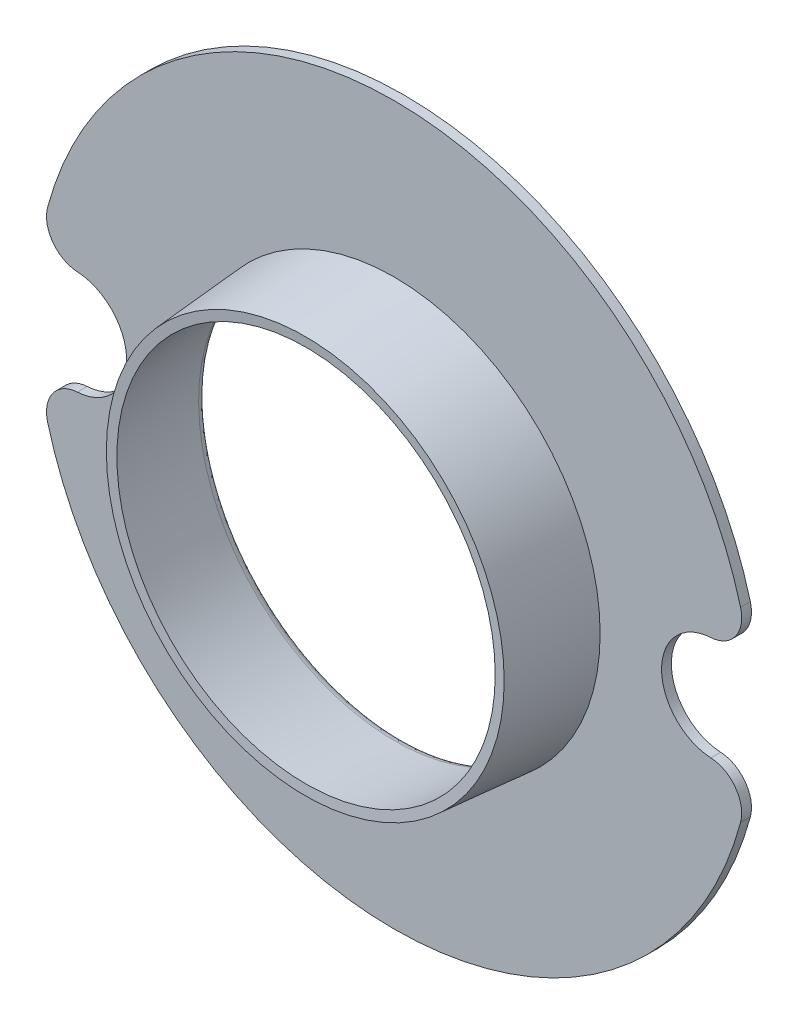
ISO-10303-21;
HEADER;
FILE_DESCRIPTION(('STEP AP214'),'2;1');
FILE_NAME('part.step','',(''),(''),'','','');
FILE_SCHEMA(('AUTOMOTIVE_DESIGN { 1 0 10303 214 1 1 1 1 }'));
ENDSEC;
DATA;
#1=APPLICATION_CONTEXT('core data for automotive mechanical design processes');
#2=APPLICATION_PROTOCOL_DEFINITION('international standard','automotive_design',2000,#1);
#3=PRODUCT_CONTEXT('',#1,'mechanical');
#4=PRODUCT('Part','Part','',(#3));
#5=PRODUCT_RELATED_PRODUCT_CATEGORY('part','',(#4));
#6=PRODUCT_DEFINITION_FORMATION('','',#4);
#7=PRODUCT_DEFINITION_CONTEXT('part definition',#1,'design');
#8=PRODUCT_DEFINITION('design','',#6,#7);
#9=PRODUCT_DEFINITION_SHAPE('','',#8);
#10=(LENGTH_UNIT() NAMED_UNIT(*) SI_UNIT(.MILLI.,.METRE.));
#11=(NAMED_UNIT(*) PLANE_ANGLE_UNIT() SI_UNIT($,.RADIAN.));
#12=(NAMED_UNIT(*) SI_UNIT($,.STERADIAN.) SOLID_ANGLE_UNIT());
#13=UNCERTAINTY_MEASURE_WITH_UNIT(LENGTH_MEASURE(1.E-05),#10,'distance_accuracy_value','');
#14=(GEOMETRIC_REPRESENTATION_CONTEXT(3) GLOBAL_UNCERTAINTY_ASSIGNED_CONTEXT((#13)) GLOBAL_UNIT_ASSIGNED_CONTEXT((#10,
#11,#12)) REPRESENTATION_CONTEXT('',''));
#15=CARTESIAN_POINT('',(0.,0.,0.));
#16=DIRECTION('',(0.,0.,1.));
#17=DIRECTION('',(1.,0.,0.));
#18=AXIS2_PLACEMENT_3D('',#15,#16,#17);
#19=CARTESIAN_POINT('',(0.,0.,16.5119617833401));
#20=DIRECTION('',(0.,0.,-1.));
#21=DIRECTION('',(-1.,0.,0.));
#22=AXIS2_PLACEMENT_3D('',#19,#20,#21);
#23=CONICAL_SURFACE('',#22,3.04952229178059,0.0798299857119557);
#24=CARTESIAN_POINT('',(0.,0.,16.5119617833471));
#25=DIRECTION('',(0.,0.,-1.));
#26=DIRECTION('',(1.,0.,0.));
#27=AXIS2_PLACEMENT_3D('',#24,#25,#26);
#28=CIRCLE('',#27,3.04952229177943);
#29=CARTESIAN_POINT('',(3.04952229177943,0.,16.5119617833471));
#30=VERTEX_POINT('',#29);
#31=EDGE_CURVE('E96',#30,#30,#28,.T.);
#32=ORIENTED_EDGE('',*,*,#31,.T.);
#33=EDGE_LOOP('',(#32));
#34=FACE_BOUND('',#33,.T.);
#35=CARTESIAN_POINT('',(0.,0.,15.1499999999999));
#36=DIRECTION('',(0.,0.,-1.));
#37=DIRECTION('',(-1.,0.,0.));
#38=AXIS2_PLACEMENT_3D('',#35,#36,#37);
#39=CIRCLE('',#38,3.15847923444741);
#40=CARTESIAN_POINT('',(-3.15847923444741,0.,15.1499999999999));
#41=VERTEX_POINT('',#40);
#42=EDGE_CURVE('E95',#41,#41,#39,.F.);
#43=ORIENTED_EDGE('',*,*,#42,.T.);
#44=EDGE_LOOP('',(#43));
#45=FACE_BOUND('',#44,.T.);
#46=ADVANCED_FACE('F16',(#34,#45),#23,.T.);
#47=CARTESIAN_POINT('',(0.,0.,16.5119617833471));
#48=DIRECTION('',(0.,0.,1.));
#49=DIRECTION('',(1.,0.,0.));
#50=AXIS2_PLACEMENT_3D('',#47,#48,#49);
#51=CONICAL_SURFACE('',#50,3.04952229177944,1.49096634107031);
#52=CARTESIAN_POINT('',(0.,0.,16.5));
#53=DIRECTION('',(0.,0.,-1.));
#54=DIRECTION('',(1.,0.,0.));
#55=AXIS2_PLACEMENT_3D('',#52,#53,#54);
#56=CIRCLE('',#55,2.89999999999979);
#57=CARTESIAN_POINT('',(2.89999999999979,0.,16.5));
#58=VERTEX_POINT('',#57);
#59=EDGE_CURVE('E139',#58,#58,#56,.T.);
#60=ORIENTED_EDGE('',*,*,#59,.T.);
#61=EDGE_LOOP('',(#60));
#62=FACE_BOUND('',#61,.T.);
#63=ORIENTED_EDGE('',*,*,#31,.F.);
#64=EDGE_LOOP('',(#63));
#65=FACE_BOUND('',#64,.T.);
#66=ADVANCED_FACE('F190',(#62,#65),#51,.F.);
#67=CARTESIAN_POINT('',(-5.541827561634,5.72,15.15));
#68=DIRECTION('',(0.,0.,-1.));
#69=DIRECTION('',(1.,0.,0.));
#70=AXIS2_PLACEMENT_3D('',#67,#68,#69);
#71=PLANE('',#70);
#72=ORIENTED_EDGE('',*,*,#42,.F.);
#73=EDGE_LOOP('',(#72));
#74=FACE_BOUND('',#73,.T.);
#75=CARTESIAN_POINT('',(4.9,0.,15.15));
#76=DIRECTION('',(0.,0.,1.));
#77=DIRECTION('',(0.,-1.,0.));
#78=AXIS2_PLACEMENT_3D('',#75,#76,#77);
#79=CIRCLE('',#78,0.8);
#80=CARTESIAN_POINT('',(4.85604395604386,-0.798791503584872,15.15));
#81=VERTEX_POINT('',#80);
#82=CARTESIAN_POINT('',(4.85604395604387,0.798791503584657,15.15));
#83=VERTEX_POINT('',#82);
#84=EDGE_CURVE('E99',#81,#83,#79,.F.);
#85=ORIENTED_EDGE('',*,*,#84,.T.);
#86=CARTESIAN_POINT('',(4.828571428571,1.298036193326,15.15));
#87=DIRECTION('',(0.,0.,-1.));
#88=DIRECTION('',(0.,1.,0.));
#89=AXIS2_PLACEMENT_3D('',#86,#87,#88);
#90=CIRCLE('',#89,0.500000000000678);
#91=CARTESIAN_POINT('',(5.31142857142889,1.42783981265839,15.15));
#92=VERTEX_POINT('',#91);
#93=EDGE_CURVE('E84',#92,#83,#90,.T.);
#94=ORIENTED_EDGE('',*,*,#93,.F.);
#95=CARTESIAN_POINT('',(0.,0.,15.15));
#96=DIRECTION('',(0.,0.,-1.));
#97=DIRECTION('',(0.,1.,0.));
#98=AXIS2_PLACEMENT_3D('',#95,#96,#97);
#99=CIRCLE('',#98,5.5);
#100=CARTESIAN_POINT('',(-5.31142857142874,1.42783981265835,15.15));
#101=VERTEX_POINT('',#100);
#102=EDGE_CURVE('E142',#92,#101,#99,.F.);
#103=ORIENTED_EDGE('',*,*,#102,.T.);
#104=CARTESIAN_POINT('',(-4.828571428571,1.298036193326,15.15));
#105=DIRECTION('',(0.,0.,1.));
#106=DIRECTION('',(0.,-1.,0.));
#107=AXIS2_PLACEMENT_3D('',#104,#105,#106);
#108=CIRCLE('',#107,0.500000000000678);
#109=CARTESIAN_POINT('',(-4.85604395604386,0.798791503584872,15.15));
#110=VERTEX_POINT('',#109);
#111=EDGE_CURVE('E135',#101,#110,#108,.T.);
#112=ORIENTED_EDGE('',*,*,#111,.T.);
#113=CARTESIAN_POINT('',(-4.9,0.,15.15));
#114=DIRECTION('',(0.,0.,-1.));
#115=DIRECTION('',(0.,1.,0.));
#116=AXIS2_PLACEMENT_3D('',#113,#114,#115);
#117=CIRCLE('',#116,0.799999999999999);
#118=CARTESIAN_POINT('',(-4.85604395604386,-0.798791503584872,15.15));
#119=VERTEX_POINT('',#118);
#120=EDGE_CURVE('E128',#110,#119,#117,.T.);
#121=ORIENTED_EDGE('',*,*,#120,.T.);
#122=CARTESIAN_POINT('',(-4.828571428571,-1.298036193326,15.15));
#123=DIRECTION('',(0.,0.,-1.));
#124=DIRECTION('',(0.,1.,0.));
#125=AXIS2_PLACEMENT_3D('',#122,#123,#124);
#126=CIRCLE('',#125,0.500000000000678);
#127=CARTESIAN_POINT('',(-5.31142857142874,-1.42783981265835,15.15));
#128=VERTEX_POINT('',#127);
#129=EDGE_CURVE('E127',#119,#128,#126,.F.);
#130=ORIENTED_EDGE('',*,*,#129,.T.);
#131=CARTESIAN_POINT('',(0.,0.,15.15));
#132=DIRECTION('',(0.,0.,-1.));
#133=DIRECTION('',(0.,1.,0.));
#134=AXIS2_PLACEMENT_3D('',#131,#132,#133);
#135=CIRCLE('',#134,5.5);
#136=CARTESIAN_POINT('',(5.31142857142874,-1.42783981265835,15.15));
#137=VERTEX_POINT('',#136);
#138=EDGE_CURVE('E123',#128,#137,#135,.F.);
#139=ORIENTED_EDGE('',*,*,#138,.T.);
#140=CARTESIAN_POINT('',(4.828571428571,-1.298036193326,15.15));
#141=DIRECTION('',(0.,0.,1.));
#142=DIRECTION('',(0.,-1.,0.));
#143=AXIS2_PLACEMENT_3D('',#140,#141,#142);
#144=CIRCLE('',#143,0.500000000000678);
#145=EDGE_CURVE('E102',#137,#81,#144,.T.);
#146=ORIENTED_EDGE('',*,*,#145,.T.);
#147=EDGE_LOOP('',(#85,#94,#103,#112,#121,#130,#139,#146));
#148=FACE_BOUND('',#147,.T.);
#149=ADVANCED_FACE('F100',(#74,#148),#71,.F.);
#150=CARTESIAN_POINT('',(0.,0.,16.5));
#151=DIRECTION('',(0.,0.,-1.));
#152=DIRECTION('',(0.,1.,0.));
#153=AXIS2_PLACEMENT_3D('',#150,#151,#152);
#154=CONICAL_SURFACE('',#153,2.89999999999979,0.0798299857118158);
#155=ORIENTED_EDGE('',*,*,#59,.F.);
#156=EDGE_LOOP('',(#155));
#157=FACE_BOUND('',#156,.T.);
#158=CARTESIAN_POINT('',(0.,0.,15.13803822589));
#159=DIRECTION('',(0.,0.,-1.));
#160=DIRECTION('',(-0.999963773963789,-0.00851180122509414,0.));
#161=AXIS2_PLACEMENT_3D('',#158,#159,#160);
#162=CIRCLE('',#161,3.0089569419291);
#163=CARTESIAN_POINT('',(-3.00884793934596,-0.0256116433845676,15.13803822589));
#164=VERTEX_POINT('',#163);
#165=EDGE_CURVE('E112',#164,#164,#162,.T.);
#166=ORIENTED_EDGE('',*,*,#165,.T.);
#167=EDGE_LOOP('',(#166));
#168=FACE_BOUND('',#167,.T.);
#169=ADVANCED_FACE('F189',(#157,#168),#154,.F.);
#170=CARTESIAN_POINT('',(0.,0.,15.15));
#171=DIRECTION('',(0.,0.,-1.));
#172=DIRECTION('',(0.,1.,0.));
#173=AXIS2_PLACEMENT_3D('',#170,#171,#172);
#174=CYLINDRICAL_SURFACE('',#173,5.5);
#175=CARTESIAN_POINT('',(0.,0.,15.));
#176=DIRECTION('',(0.,0.,-1.));
#177=DIRECTION('',(0.,1.,0.));
#178=AXIS2_PLACEMENT_3D('',#175,#176,#177);
#179=CIRCLE('',#178,5.5);
#180=CARTESIAN_POINT('',(5.31142857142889,1.42783981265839,15.));
#181=VERTEX_POINT('',#180);
#182=CARTESIAN_POINT('',(-5.31142857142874,1.42783981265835,15.));
#183=VERTEX_POINT('',#182);
#184=EDGE_CURVE('E138',#181,#183,#179,.F.);
#185=ORIENTED_EDGE('',*,*,#184,.T.);
#186=DIRECTION('',(0.,0.,1.));
#187=VECTOR('',#186,1.);
#188=CARTESIAN_POINT('',(-5.311428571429,1.427839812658,15.075));
#189=LINE('',#188,#187);
#190=EDGE_CURVE('E132',#183,#101,#189,.T.);
#191=ORIENTED_EDGE('',*,*,#190,.T.);
#192=ORIENTED_EDGE('',*,*,#102,.F.);
#193=DIRECTION('',(0.,0.,-1.));
#194=VECTOR('',#193,1.);
#195=CARTESIAN_POINT('',(5.311428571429,1.427839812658,15.075));
#196=LINE('',#195,#194);
#197=EDGE_CURVE('E94',#92,#181,#196,.T.);
#198=ORIENTED_EDGE('',*,*,#197,.T.);
#199=EDGE_LOOP('',(#185,#191,#192,#198));
#200=FACE_BOUND('',#199,.T.);
#201=ADVANCED_FACE('F196',(#200),#174,.T.);
#202=CARTESIAN_POINT('',(-4.828571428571,1.298036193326,15.));
#203=DIRECTION('',(0.,0.,1.));
#204=DIRECTION('',(0.,-1.,0.));
#205=AXIS2_PLACEMENT_3D('',#202,#203,#204);
#206=CYLINDRICAL_SURFACE('',#205,0.500000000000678);
#207=CARTESIAN_POINT('',(-4.828571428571,1.298036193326,15.));
#208=DIRECTION('',(0.,0.,1.));
#209=DIRECTION('',(0.,-1.,0.));
#210=AXIS2_PLACEMENT_3D('',#207,#208,#209);
#211=CIRCLE('',#210,0.500000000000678);
#212=CARTESIAN_POINT('',(-4.85604395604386,0.798791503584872,15.));
#213=VERTEX_POINT('',#212);
#214=EDGE_CURVE('E175',#183,#213,#211,.T.);
#215=ORIENTED_EDGE('',*,*,#214,.T.);
#216=DIRECTION('',(0.,0.,-1.));
#217=VECTOR('',#216,1.);
#218=CARTESIAN_POINT('',(-4.856043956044,0.798791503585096,15.075));
#219=LINE('',#218,#217);
#220=EDGE_CURVE('E129',#213,#110,#219,.F.);
#221=ORIENTED_EDGE('',*,*,#220,.T.);
#222=ORIENTED_EDGE('',*,*,#111,.F.);
#223=ORIENTED_EDGE('',*,*,#190,.F.);
#224=EDGE_LOOP('',(#215,#221,#222,#223));
#225=FACE_BOUND('',#224,.T.);
#226=ADVANCED_FACE('F217',(#225),#206,.T.);
#227=CARTESIAN_POINT('',(-4.9,0.,15.15));
#228=DIRECTION('',(0.,0.,-1.));
#229=DIRECTION('',(0.,1.,0.));
#230=AXIS2_PLACEMENT_3D('',#227,#228,#229);
#231=CYLINDRICAL_SURFACE('',#230,0.799999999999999);
#232=DIRECTION('',(0.,0.,1.));
#233=VECTOR('',#232,1.);
#234=CARTESIAN_POINT('',(-4.85604395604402,-0.798791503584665,15.075));
#235=LINE('',#234,#233);
#236=CARTESIAN_POINT('',(-4.85604395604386,-0.798791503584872,15.));
#237=VERTEX_POINT('',#236);
#238=EDGE_CURVE('E124',#237,#119,#235,.T.);
#239=ORIENTED_EDGE('',*,*,#238,.T.);
#240=ORIENTED_EDGE('',*,*,#120,.F.);
#241=ORIENTED_EDGE('',*,*,#220,.F.);
#242=CARTESIAN_POINT('',(-4.9,0.,15.));
#243=DIRECTION('',(0.,0.,-1.));
#244=DIRECTION('',(0.,1.,0.));
#245=AXIS2_PLACEMENT_3D('',#242,#243,#244);
#246=CIRCLE('',#245,0.799999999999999);
#247=EDGE_CURVE('E173',#213,#237,#246,.T.);
#248=ORIENTED_EDGE('',*,*,#247,.T.);
#249=EDGE_LOOP('',(#239,#240,#241,#248));
#250=FACE_BOUND('',#249,.T.);
#251=ADVANCED_FACE('F223',(#250),#231,.F.);
#252=CARTESIAN_POINT('',(-4.828571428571,-1.298036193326,15.15));
#253=DIRECTION('',(0.,0.,-1.));
#254=DIRECTION('',(0.,1.,0.));
#255=AXIS2_PLACEMENT_3D('',#252,#253,#254);
#256=CYLINDRICAL_SURFACE('',#255,0.500000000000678);
#257=ORIENTED_EDGE('',*,*,#129,.F.);
#258=ORIENTED_EDGE('',*,*,#238,.F.);
#259=CARTESIAN_POINT('',(-4.828571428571,-1.298036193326,15.));
#260=DIRECTION('',(0.,0.,-1.));
#261=DIRECTION('',(0.,1.,0.));
#262=AXIS2_PLACEMENT_3D('',#259,#260,#261);
#263=CIRCLE('',#262,0.500000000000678);
#264=CARTESIAN_POINT('',(-5.31142857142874,-1.42783981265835,15.));
#265=VERTEX_POINT('',#264);
#266=EDGE_CURVE('E171',#237,#265,#263,.F.);
#267=ORIENTED_EDGE('',*,*,#266,.T.);
#268=DIRECTION('',(0.,0.,1.));
#269=VECTOR('',#268,1.);
#270=CARTESIAN_POINT('',(-5.31142857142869,-1.42783981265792,15.075));
#271=LINE('',#270,#269);
#272=EDGE_CURVE('E120',#265,#128,#271,.T.);
#273=ORIENTED_EDGE('',*,*,#272,.T.);
#274=EDGE_LOOP('',(#257,#258,#267,#273));
#275=FACE_BOUND('',#274,.T.);
#276=ADVANCED_FACE('F226',(#275),#256,.T.);
#277=CARTESIAN_POINT('',(0.,0.,15.15));
#278=DIRECTION('',(0.,0.,-1.));
#279=DIRECTION('',(0.,1.,0.));
#280=AXIS2_PLACEMENT_3D('',#277,#278,#279);
#281=CYLINDRICAL_SURFACE('',#280,5.5);
#282=CARTESIAN_POINT('',(0.,0.,15.));
#283=DIRECTION('',(0.,0.,-1.));
#284=DIRECTION('',(0.,1.,0.));
#285=AXIS2_PLACEMENT_3D('',#282,#283,#284);
#286=CIRCLE('',#285,5.5);
#287=CARTESIAN_POINT('',(5.31142857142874,-1.42783981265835,15.));
#288=VERTEX_POINT('',#287);
#289=EDGE_CURVE('E169',#265,#288,#286,.F.);
#290=ORIENTED_EDGE('',*,*,#289,.T.);
#291=DIRECTION('',(0.,0.,1.));
#292=VECTOR('',#291,1.);
#293=CARTESIAN_POINT('',(5.311428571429,-1.427839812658,15.075));
#294=LINE('',#293,#292);
#295=EDGE_CURVE('E117',#288,#137,#294,.T.);
#296=ORIENTED_EDGE('',*,*,#295,.T.);
#297=ORIENTED_EDGE('',*,*,#138,.F.);
#298=ORIENTED_EDGE('',*,*,#272,.F.);
#299=EDGE_LOOP('',(#290,#296,#297,#298));
#300=FACE_BOUND('',#299,.T.);
#301=ADVANCED_FACE('F230',(#300),#281,.T.);
#302=CARTESIAN_POINT('',(4.828571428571,-1.298036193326,15.));
#303=DIRECTION('',(0.,0.,1.));
#304=DIRECTION('',(0.,-1.,0.));
#305=AXIS2_PLACEMENT_3D('',#302,#303,#304);
#306=CYLINDRICAL_SURFACE('',#305,0.500000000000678);
#307=CARTESIAN_POINT('',(4.828571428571,-1.298036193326,15.));
#308=DIRECTION('',(0.,0.,1.));
#309=DIRECTION('',(0.,-1.,0.));
#310=AXIS2_PLACEMENT_3D('',#307,#308,#309);
#311=CIRCLE('',#310,0.500000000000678);
#312=CARTESIAN_POINT('',(4.85604395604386,-0.798791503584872,15.));
#313=VERTEX_POINT('',#312);
#314=EDGE_CURVE('E167',#288,#313,#311,.T.);
#315=ORIENTED_EDGE('',*,*,#314,.T.);
#316=DIRECTION('',(0.,0.,-1.));
#317=VECTOR('',#316,1.);
#318=CARTESIAN_POINT('',(4.856043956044,-0.798791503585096,15.075));
#319=LINE('',#318,#317);
#320=EDGE_CURVE('E106',#313,#81,#319,.F.);
#321=ORIENTED_EDGE('',*,*,#320,.T.);
#322=ORIENTED_EDGE('',*,*,#145,.F.);
#323=ORIENTED_EDGE('',*,*,#295,.F.);
#324=EDGE_LOOP('',(#315,#321,#322,#323));
#325=FACE_BOUND('',#324,.T.);
#326=ADVANCED_FACE('F233',(#325),#306,.T.);
#327=CARTESIAN_POINT('',(4.9,0.,15.));
#328=DIRECTION('',(0.,0.,1.));
#329=DIRECTION('',(0.,-1.,0.));
#330=AXIS2_PLACEMENT_3D('',#327,#328,#329);
#331=CYLINDRICAL_SURFACE('',#330,0.8);
#332=ORIENTED_EDGE('',*,*,#320,.F.);
#333=CARTESIAN_POINT('',(4.9,0.,15.));
#334=DIRECTION('',(0.,0.,1.));
#335=DIRECTION('',(0.,-1.,0.));
#336=AXIS2_PLACEMENT_3D('',#333,#334,#335);
#337=CIRCLE('',#336,0.8);
#338=CARTESIAN_POINT('',(4.85604395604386,0.798791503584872,15.));
#339=VERTEX_POINT('',#338);
#340=EDGE_CURVE('E110',#313,#339,#337,.F.);
#341=ORIENTED_EDGE('',*,*,#340,.T.);
#342=DIRECTION('',(0.,0.,1.));
#343=VECTOR('',#342,1.);
#344=CARTESIAN_POINT('',(4.85604395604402,0.798791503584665,15.075));
#345=LINE('',#344,#343);
#346=EDGE_CURVE('E92',#339,#83,#345,.T.);
#347=ORIENTED_EDGE('',*,*,#346,.T.);
#348=ORIENTED_EDGE('',*,*,#84,.F.);
#349=EDGE_LOOP('',(#332,#341,#347,#348));
#350=FACE_BOUND('',#349,.T.);
#351=ADVANCED_FACE('F108',(#350),#331,.F.);
#352=CARTESIAN_POINT('',(4.828571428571,1.298036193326,15.15));
#353=DIRECTION('',(0.,0.,-1.));
#354=DIRECTION('',(0.,1.,0.));
#355=AXIS2_PLACEMENT_3D('',#352,#353,#354);
#356=CYLINDRICAL_SURFACE('',#355,0.500000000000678);
#357=ORIENTED_EDGE('',*,*,#93,.T.);
#358=ORIENTED_EDGE('',*,*,#346,.F.);
#359=CARTESIAN_POINT('',(4.828571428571,1.298036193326,15.));
#360=DIRECTION('',(0.,0.,-1.));
#361=DIRECTION('',(0.,1.,0.));
#362=AXIS2_PLACEMENT_3D('',#359,#360,#361);
#363=CIRCLE('',#362,0.500000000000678);
#364=EDGE_CURVE('E159',#339,#181,#363,.F.);
#365=ORIENTED_EDGE('',*,*,#364,.T.);
#366=ORIENTED_EDGE('',*,*,#197,.F.);
#367=EDGE_LOOP('',(#357,#358,#365,#366));
#368=FACE_BOUND('',#367,.T.);
#369=ADVANCED_FACE('F89',(#368),#356,.T.);
#370=CARTESIAN_POINT('',(-3.17707368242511,-0.0270435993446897,15.0011713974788));
#371=CARTESIAN_POINT('',(-3.07763276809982,-0.0261971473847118,14.9886700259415));
#372=CARTESIAN_POINT('',(-3.00399245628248,-0.0255703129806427,15.0566568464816));
#373=CARTESIAN_POINT('',(-3.00852362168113,-0.0256088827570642,15.1567815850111));
#374=(BOUNDED_CURVE() B_SPLINE_CURVE(3,(#370,#371,#372,#373),.UNSPECIFIED.,.F.,
.F.) B_SPLINE_CURVE_WITH_KNOTS((4,4),(0.,1.),
.UNSPECIFIED.) CURVE() GEOMETRIC_REPRESENTATION_ITEM() RATIONAL_B_SPLINE_CURVE((1.,
0.762942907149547,0.762942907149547,1.)) REPRESENTATION_ITEM(''));
#375=CARTESIAN_POINT('',(0.,0.,15.15));
#376=DIRECTION('',(0.,0.,-1.));
#377=AXIS1_PLACEMENT('',#375,#376);
#378=SURFACE_OF_REVOLUTION('',#374,#377);
#379=CARTESIAN_POINT('',(0.,0.,15.));
#380=DIRECTION('',(0.,0.,-1.));
#381=DIRECTION('',(-1.,-1.90839376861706E-13,0.));
#382=AXIS2_PLACEMENT_3D('',#379,#380,#381);
#383=CIRCLE('',#382,3.15847917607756);
#384=CARTESIAN_POINT('',(-3.15847915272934,-3.62210833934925E-13,15.));
#385=VERTEX_POINT('',#384);
#386=CARTESIAN_POINT('',(3.15847915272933,3.61909946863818E-13,15.));
#387=VERTEX_POINT('',#386);
#388=EDGE_CURVE('E11',#385,#387,#383,.T.);
#389=ORIENTED_EDGE('',*,*,#388,.T.);
#390=CARTESIAN_POINT('',(0.,0.,15.));
#391=DIRECTION('',(0.,0.,-1.));
#392=DIRECTION('',(1.,1.90832940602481E-13,0.));
#393=AXIS2_PLACEMENT_3D('',#390,#391,#392);
#394=CIRCLE('',#393,3.15847917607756);
#395=EDGE_CURVE('E29',#387,#385,#394,.T.);
#396=ORIENTED_EDGE('',*,*,#395,.T.);
#397=EDGE_LOOP('',(#389,#396));
#398=FACE_BOUND('',#397,.T.);
#399=ORIENTED_EDGE('',*,*,#165,.F.);
#400=EDGE_LOOP('',(#399));
#401=FACE_BOUND('',#400,.T.);
#402=ADVANCED_FACE('F203',(#398,#401),#378,.T.);
#403=CARTESIAN_POINT('',(-5.541827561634,5.72,15.));
#404=DIRECTION('',(0.,0.,-1.));
#405=DIRECTION('',(1.,0.,0.));
#406=AXIS2_PLACEMENT_3D('',#403,#404,#405);
#407=PLANE('',#406);
#408=ORIENTED_EDGE('',*,*,#395,.F.);
#409=ORIENTED_EDGE('',*,*,#388,.F.);
#410=EDGE_LOOP('',(#408,#409));
#411=FACE_BOUND('',#410,.T.);
#412=ORIENTED_EDGE('',*,*,#340,.F.);
#413=ORIENTED_EDGE('',*,*,#314,.F.);
#414=ORIENTED_EDGE('',*,*,#289,.F.);
#415=ORIENTED_EDGE('',*,*,#266,.F.);
#416=ORIENTED_EDGE('',*,*,#247,.F.);
#417=ORIENTED_EDGE('',*,*,#214,.F.);
#418=ORIENTED_EDGE('',*,*,#184,.F.);
#419=ORIENTED_EDGE('',*,*,#364,.F.);
#420=EDGE_LOOP('',(#412,#413,#414,#415,#416,#417,#418,#419));
#421=FACE_BOUND('',#420,.T.);
#422=ADVANCED_FACE('F18',(#411,#421),#407,.T.);
#423=CLOSED_SHELL('',(#46,#66,#149,#169,#201,#226,#251,#276,#301,#326,#351,#369,#402,#422));
#424=MANIFOLD_SOLID_BREP('B1',#423);
#425=ADVANCED_BREP_SHAPE_REPRESENTATION('',(#18,#424),#14);
#426=SHAPE_DEFINITION_REPRESENTATION(#9,#425);
ENDSEC;
END-ISO-10303-21;
